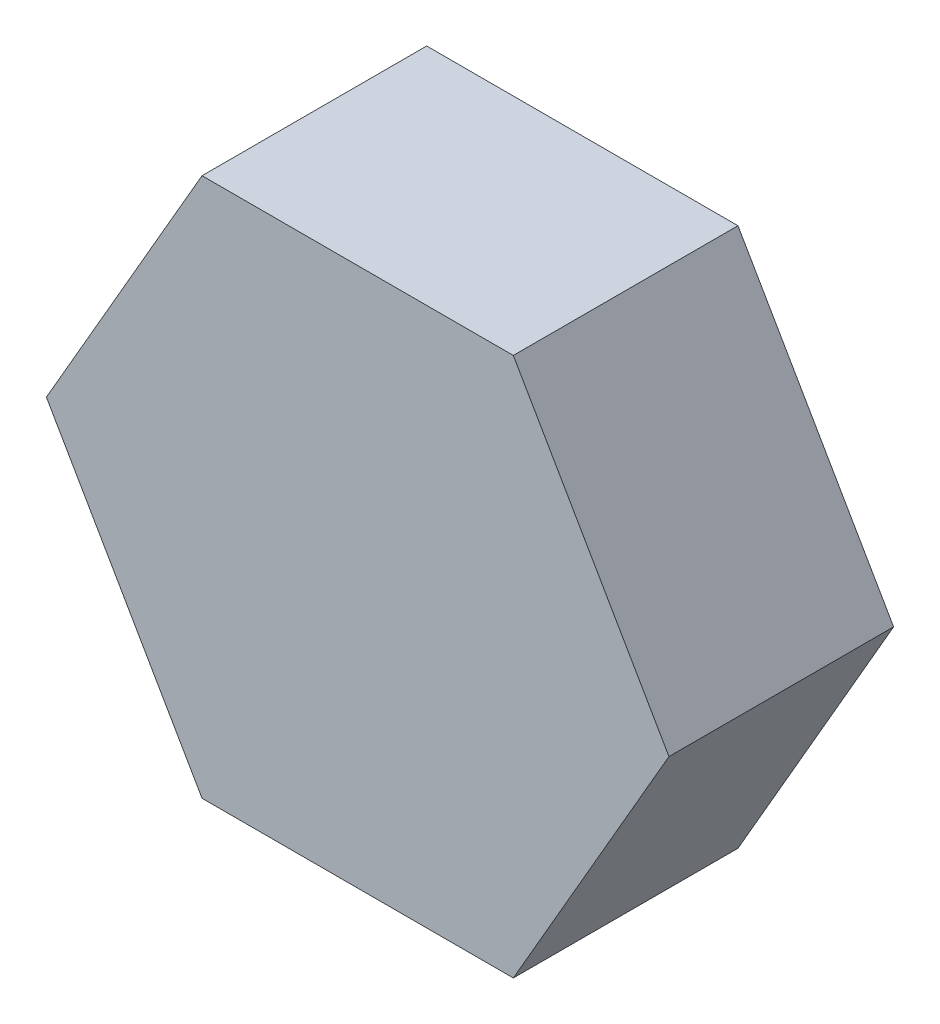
ISO-10303-21;
HEADER;
FILE_DESCRIPTION(('STEP AP214'),'2;1');
FILE_NAME('part.step','',(''),(''),'','','');
FILE_SCHEMA(('AUTOMOTIVE_DESIGN { 1 0 10303 214 1 1 1 1 }'));
ENDSEC;
DATA;
#1=APPLICATION_CONTEXT('core data for automotive mechanical design processes');
#2=APPLICATION_PROTOCOL_DEFINITION('international standard','automotive_design',2000,#1);
#3=PRODUCT_CONTEXT('',#1,'mechanical');
#4=PRODUCT('Part','Part','',(#3));
#5=PRODUCT_RELATED_PRODUCT_CATEGORY('part','',(#4));
#6=PRODUCT_DEFINITION_FORMATION('','',#4);
#7=PRODUCT_DEFINITION_CONTEXT('part definition',#1,'design');
#8=PRODUCT_DEFINITION('design','',#6,#7);
#9=PRODUCT_DEFINITION_SHAPE('','',#8);
#10=(LENGTH_UNIT() NAMED_UNIT(*) SI_UNIT(.MILLI.,.METRE.));
#11=(NAMED_UNIT(*) PLANE_ANGLE_UNIT() SI_UNIT($,.RADIAN.));
#12=(NAMED_UNIT(*) SI_UNIT($,.STERADIAN.) SOLID_ANGLE_UNIT());
#13=UNCERTAINTY_MEASURE_WITH_UNIT(LENGTH_MEASURE(1.E-05),#10,'distance_accuracy_value','');
#14=(GEOMETRIC_REPRESENTATION_CONTEXT(3) GLOBAL_UNCERTAINTY_ASSIGNED_CONTEXT((#13)) GLOBAL_UNIT_ASSIGNED_CONTEXT((#10,
#11,#12)) REPRESENTATION_CONTEXT('',''));
#15=CARTESIAN_POINT('',(0.,0.,0.));
#16=DIRECTION('',(0.,0.,1.));
#17=DIRECTION('',(1.,0.,0.));
#18=AXIS2_PLACEMENT_3D('',#15,#16,#17);
#19=CARTESIAN_POINT('',(-4.12444598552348,7.14375,2.9765625));
#20=DIRECTION('',(0.,0.,-1.));
#21=DIRECTION('',(-1.,0.,0.));
#22=AXIS2_PLACEMENT_3D('',#19,#20,#21);
#23=PLANE('',#22);
#24=DIRECTION('',(-0.499999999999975,-0.866025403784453,0.));
#25=VECTOR('',#24,1.);
#26=CARTESIAN_POINT('',(-8.2488919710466,0.,2.9765625));
#27=LINE('',#26,#25);
#28=CARTESIAN_POINT('',(-8.2488919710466,0.,2.9765625));
#29=VERTEX_POINT('',#28);
#30=CARTESIAN_POINT('',(-4.12444598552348,7.14375,2.9765625));
#31=VERTEX_POINT('',#30);
#32=EDGE_CURVE('E19',#29,#31,#27,.F.);
#33=ORIENTED_EDGE('',*,*,#32,.F.);
#34=DIRECTION('',(0.499999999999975,-0.866025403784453,0.));
#35=VECTOR('',#34,1.);
#36=CARTESIAN_POINT('',(-4.12444598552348,-7.14375,2.9765625));
#37=LINE('',#36,#35);
#38=CARTESIAN_POINT('',(-4.12444598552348,-7.14375,2.9765625));
#39=VERTEX_POINT('',#38);
#40=EDGE_CURVE('E102',#39,#29,#37,.F.);
#41=ORIENTED_EDGE('',*,*,#40,.F.);
#42=DIRECTION('',(1.,0.,0.));
#43=VECTOR('',#42,1.);
#44=CARTESIAN_POINT('',(4.12444598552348,-7.14375,2.9765625));
#45=LINE('',#44,#43);
#46=CARTESIAN_POINT('',(4.12444598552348,-7.14375,2.9765625));
#47=VERTEX_POINT('',#46);
#48=EDGE_CURVE('E97',#47,#39,#45,.F.);
#49=ORIENTED_EDGE('',*,*,#48,.F.);
#50=DIRECTION('',(0.499999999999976,0.866025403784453,0.));
#51=VECTOR('',#50,1.);
#52=CARTESIAN_POINT('',(8.2488919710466,0.,2.9765625));
#53=LINE('',#52,#51);
#54=CARTESIAN_POINT('',(8.24889197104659,0.,2.9765625));
#55=VERTEX_POINT('',#54);
#56=EDGE_CURVE('E91',#55,#47,#53,.F.);
#57=ORIENTED_EDGE('',*,*,#56,.F.);
#58=DIRECTION('',(-0.499999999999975,0.866025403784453,0.));
#59=VECTOR('',#58,1.);
#60=CARTESIAN_POINT('',(4.12444598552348,7.14375,2.9765625));
#61=LINE('',#60,#59);
#62=CARTESIAN_POINT('',(4.12444598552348,7.14375,2.9765625));
#63=VERTEX_POINT('',#62);
#64=EDGE_CURVE('E67',#63,#55,#61,.F.);
#65=ORIENTED_EDGE('',*,*,#64,.F.);
#66=DIRECTION('',(1.,0.,0.));
#67=VECTOR('',#66,1.);
#68=CARTESIAN_POINT('',(-4.12444598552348,7.14375,2.9765625));
#69=LINE('',#68,#67);
#70=EDGE_CURVE('E69',#31,#63,#69,.T.);
#71=ORIENTED_EDGE('',*,*,#70,.F.);
#72=EDGE_LOOP('',(#33,#41,#49,#57,#65,#71));
#73=FACE_BOUND('',#72,.T.);
#74=ADVANCED_FACE('F16',(#73),#23,.F.);
#75=CARTESIAN_POINT('',(-8.2488919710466,0.,-2.9765625));
#76=DIRECTION('',(-0.866025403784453,0.499999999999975,0.));
#77=DIRECTION('',(-0.499999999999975,-0.866025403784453,0.));
#78=AXIS2_PLACEMENT_3D('',#75,#76,#77);
#79=PLANE('',#78);
#80=DIRECTION('',(0.499999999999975,0.866025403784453,0.));
#81=VECTOR('',#80,1.);
#82=CARTESIAN_POINT('',(-8.2488919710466,0.,-2.9765625));
#83=LINE('',#82,#81);
#84=CARTESIAN_POINT('',(-8.2488919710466,0.,-2.9765625));
#85=VERTEX_POINT('',#84);
#86=CARTESIAN_POINT('',(-4.12444598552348,7.14375,-2.9765625));
#87=VERTEX_POINT('',#86);
#88=EDGE_CURVE('E106',#85,#87,#83,.T.);
#89=ORIENTED_EDGE('',*,*,#88,.F.);
#90=DIRECTION('',(0.,0.,1.));
#91=VECTOR('',#90,1.);
#92=CARTESIAN_POINT('',(-8.2488919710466,0.,-2.9765625));
#93=LINE('',#92,#91);
#94=EDGE_CURVE('E80',#29,#85,#93,.F.);
#95=ORIENTED_EDGE('',*,*,#94,.F.);
#96=ORIENTED_EDGE('',*,*,#32,.T.);
#97=DIRECTION('',(0.,0.,1.));
#98=VECTOR('',#97,1.);
#99=CARTESIAN_POINT('',(-4.12444598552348,7.14375,-2.9765625));
#100=LINE('',#99,#98);
#101=EDGE_CURVE('E75',#87,#31,#100,.T.);
#102=ORIENTED_EDGE('',*,*,#101,.F.);
#103=EDGE_LOOP('',(#89,#95,#96,#102));
#104=FACE_BOUND('',#103,.T.);
#105=ADVANCED_FACE('F77',(#104),#79,.T.);
#106=CARTESIAN_POINT('',(-4.12444598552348,7.14375,-2.9765625));
#107=DIRECTION('',(0.,1.,0.));
#108=DIRECTION('',(0.,0.,1.));
#109=AXIS2_PLACEMENT_3D('',#106,#107,#108);
#110=PLANE('',#109);
#111=DIRECTION('',(-1.,0.,0.));
#112=VECTOR('',#111,1.);
#113=CARTESIAN_POINT('',(0.,7.14375,-2.9765625));
#114=LINE('',#113,#112);
#115=CARTESIAN_POINT('',(4.12444598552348,7.14375,-2.9765625));
#116=VERTEX_POINT('',#115);
#117=EDGE_CURVE('E84',#87,#116,#114,.F.);
#118=ORIENTED_EDGE('',*,*,#117,.F.);
#119=ORIENTED_EDGE('',*,*,#101,.T.);
#120=ORIENTED_EDGE('',*,*,#70,.T.);
#121=DIRECTION('',(0.,0.,1.));
#122=VECTOR('',#121,1.);
#123=CARTESIAN_POINT('',(4.12444598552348,7.14375,-2.9765625));
#124=LINE('',#123,#122);
#125=EDGE_CURVE('E87',#116,#63,#124,.T.);
#126=ORIENTED_EDGE('',*,*,#125,.F.);
#127=EDGE_LOOP('',(#118,#119,#120,#126));
#128=FACE_BOUND('',#127,.T.);
#129=ADVANCED_FACE('F82',(#128),#110,.T.);
#130=CARTESIAN_POINT('',(4.12444598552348,7.14375,-2.9765625));
#131=DIRECTION('',(0.866025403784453,0.499999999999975,0.));
#132=DIRECTION('',(-0.499999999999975,0.866025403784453,0.));
#133=AXIS2_PLACEMENT_3D('',#130,#131,#132);
#134=PLANE('',#133);
#135=DIRECTION('',(0.499999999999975,-0.866025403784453,0.));
#136=VECTOR('',#135,1.);
#137=CARTESIAN_POINT('',(4.12444598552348,7.14375,-2.9765625));
#138=LINE('',#137,#136);
#139=CARTESIAN_POINT('',(8.2488919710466,0.,-2.9765625));
#140=VERTEX_POINT('',#139);
#141=EDGE_CURVE('E109',#116,#140,#138,.T.);
#142=ORIENTED_EDGE('',*,*,#141,.F.);
#143=ORIENTED_EDGE('',*,*,#125,.T.);
#144=ORIENTED_EDGE('',*,*,#64,.T.);
#145=DIRECTION('',(0.,0.,1.));
#146=VECTOR('',#145,1.);
#147=CARTESIAN_POINT('',(8.2488919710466,0.,-2.9765625));
#148=LINE('',#147,#146);
#149=EDGE_CURVE('E94',#140,#55,#148,.T.);
#150=ORIENTED_EDGE('',*,*,#149,.F.);
#151=EDGE_LOOP('',(#142,#143,#144,#150));
#152=FACE_BOUND('',#151,.T.);
#153=ADVANCED_FACE('F124',(#152),#134,.T.);
#154=CARTESIAN_POINT('',(8.2488919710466,0.,-2.9765625));
#155=DIRECTION('',(0.866025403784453,-0.499999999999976,0.));
#156=DIRECTION('',(0.499999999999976,0.866025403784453,0.));
#157=AXIS2_PLACEMENT_3D('',#154,#155,#156);
#158=PLANE('',#157);
#159=DIRECTION('',(-0.499999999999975,-0.866025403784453,0.));
#160=VECTOR('',#159,1.);
#161=CARTESIAN_POINT('',(8.2488919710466,0.,-2.9765625));
#162=LINE('',#161,#160);
#163=CARTESIAN_POINT('',(4.12444598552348,-7.14375,-2.9765625));
#164=VERTEX_POINT('',#163);
#165=EDGE_CURVE('E112',#140,#164,#162,.T.);
#166=ORIENTED_EDGE('',*,*,#165,.F.);
#167=ORIENTED_EDGE('',*,*,#149,.T.);
#168=ORIENTED_EDGE('',*,*,#56,.T.);
#169=DIRECTION('',(0.,0.,1.));
#170=VECTOR('',#169,1.);
#171=CARTESIAN_POINT('',(4.12444598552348,-7.14375,-2.9765625));
#172=LINE('',#171,#170);
#173=EDGE_CURVE('E99',#164,#47,#172,.T.);
#174=ORIENTED_EDGE('',*,*,#173,.F.);
#175=EDGE_LOOP('',(#166,#167,#168,#174));
#176=FACE_BOUND('',#175,.T.);
#177=ADVANCED_FACE('F121',(#176),#158,.T.);
#178=CARTESIAN_POINT('',(4.12444598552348,-7.14375,-2.9765625));
#179=DIRECTION('',(0.,-1.,0.));
#180=DIRECTION('',(1.,0.,0.));
#181=AXIS2_PLACEMENT_3D('',#178,#179,#180);
#182=PLANE('',#181);
#183=DIRECTION('',(-1.,0.,0.));
#184=VECTOR('',#183,1.);
#185=CARTESIAN_POINT('',(0.,-7.14375,-2.9765625));
#186=LINE('',#185,#184);
#187=CARTESIAN_POINT('',(-4.12444598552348,-7.14375,-2.9765625));
#188=VERTEX_POINT('',#187);
#189=EDGE_CURVE('E25',#164,#188,#186,.T.);
#190=ORIENTED_EDGE('',*,*,#189,.F.);
#191=ORIENTED_EDGE('',*,*,#173,.T.);
#192=ORIENTED_EDGE('',*,*,#48,.T.);
#193=DIRECTION('',(0.,0.,1.));
#194=VECTOR('',#193,1.);
#195=CARTESIAN_POINT('',(-4.12444598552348,-7.14375,-2.9765625));
#196=LINE('',#195,#194);
#197=EDGE_CURVE('E34',#188,#39,#196,.T.);
#198=ORIENTED_EDGE('',*,*,#197,.F.);
#199=EDGE_LOOP('',(#190,#191,#192,#198));
#200=FACE_BOUND('',#199,.T.);
#201=ADVANCED_FACE('F119',(#200),#182,.T.);
#202=CARTESIAN_POINT('',(-4.12444598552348,-7.14375,-2.9765625));
#203=DIRECTION('',(-0.866025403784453,-0.499999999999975,0.));
#204=DIRECTION('',(0.499999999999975,-0.866025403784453,0.));
#205=AXIS2_PLACEMENT_3D('',#202,#203,#204);
#206=PLANE('',#205);
#207=DIRECTION('',(-0.499999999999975,0.866025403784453,0.));
#208=VECTOR('',#207,1.);
#209=CARTESIAN_POINT('',(-4.12444598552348,-7.14375,-2.9765625));
#210=LINE('',#209,#208);
#211=EDGE_CURVE('E11',#188,#85,#210,.T.);
#212=ORIENTED_EDGE('',*,*,#211,.F.);
#213=ORIENTED_EDGE('',*,*,#197,.T.);
#214=ORIENTED_EDGE('',*,*,#40,.T.);
#215=ORIENTED_EDGE('',*,*,#94,.T.);
#216=EDGE_LOOP('',(#212,#213,#214,#215));
#217=FACE_BOUND('',#216,.T.);
#218=ADVANCED_FACE('F126',(#217),#206,.T.);
#219=CARTESIAN_POINT('',(0.,0.,-2.9765625));
#220=DIRECTION('',(0.,0.,-1.));
#221=DIRECTION('',(-1.,0.,0.));
#222=AXIS2_PLACEMENT_3D('',#219,#220,#221);
#223=PLANE('',#222);
#224=ORIENTED_EDGE('',*,*,#189,.T.);
#225=ORIENTED_EDGE('',*,*,#211,.T.);
#226=ORIENTED_EDGE('',*,*,#88,.T.);
#227=ORIENTED_EDGE('',*,*,#117,.T.);
#228=ORIENTED_EDGE('',*,*,#141,.T.);
#229=ORIENTED_EDGE('',*,*,#165,.T.);
#230=EDGE_LOOP('',(#224,#225,#226,#227,#228,#229));
#231=FACE_BOUND('',#230,.T.);
#232=ADVANCED_FACE('F117',(#231),#223,.T.);
#233=CLOSED_SHELL('',(#74,#105,#129,#153,#177,#201,#218,#232));
#234=MANIFOLD_SOLID_BREP('B1',#233);
#235=ADVANCED_BREP_SHAPE_REPRESENTATION('',(#18,#234),#14);
#236=SHAPE_DEFINITION_REPRESENTATION(#9,#235);
ENDSEC;
END-ISO-10303-21;
